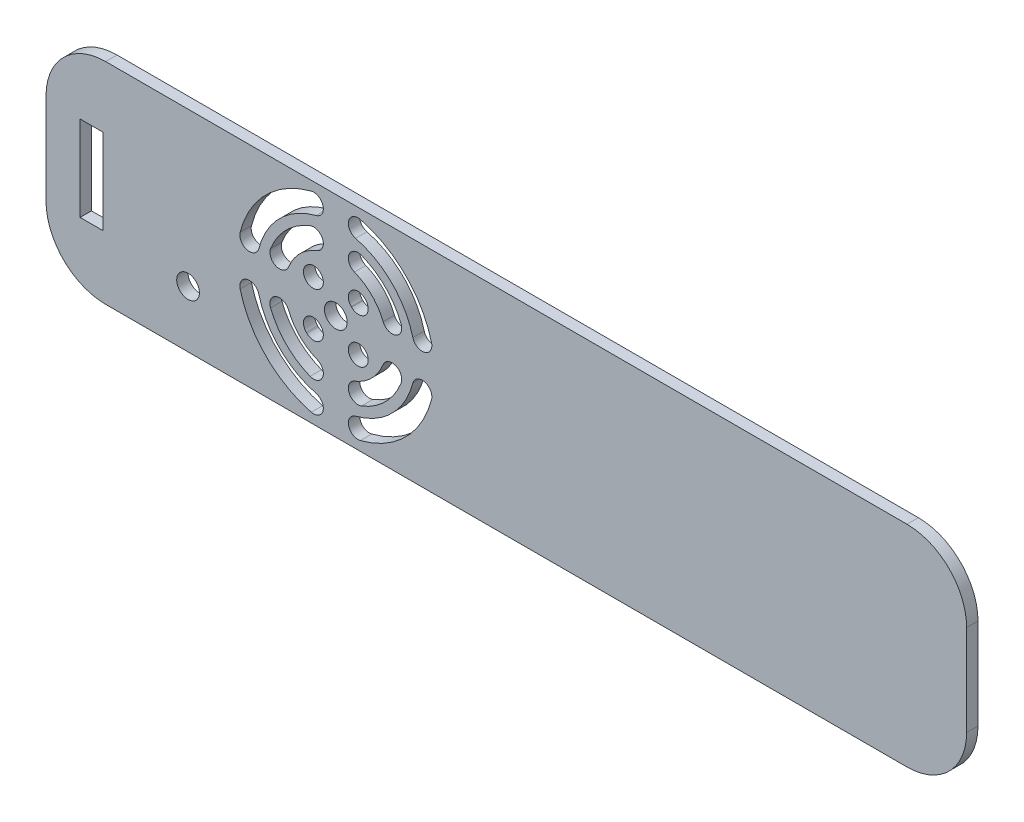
from build123d import *

# Parameters (mm, degrees)
EXTRUDE_1_DEPTH     = 2
SKETCH_2_W          = 4
SKETCH_2_H          = 15
CUT_EXTRUDE_1_DEPTH = 84.109867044
SKETCH_3_R          = 2
CUT_EXTRUDE_2_DEPTH = 84.109867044
SKETCH_4_R          = 2
CUT_EXTRUDE_3_DEPTH = 84.109867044


with BuildPart() as part:
    # Sketch 1 → Extrude 1 (new body)
    with BuildSketch(Plane.XY):
        with BuildLine():
            Line((-70.5, 18.5), (70.5, 18.5))
            ThreePointArc((70.5, 18.5), (77.924621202, 15.424621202), (81, 8))
            Line((81, 8), (81, -8))
            ThreePointArc((81, -8), (77.924621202, -15.424621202), (70.5, -18.5))
            Line((70.5, -18.5), (-70.5, -18.5))
            ThreePointArc((-70.5, -18.5), (-77.924621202, -15.424621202), (-81, -8))
            Line((-81, -8), (-81, 8))
            ThreePointArc((-81, 8), (-77.924621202, 15.424621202), (-70.5, 18.5))
        make_face()
    extrude(amount=EXTRUDE_1_DEPTH)

    # Sketch 2 → Cut-Extrude 1 (cut, through all)
    with BuildSketch(Plane.XY.offset(2)):
        with Locations((-73, 0)):
            Rectangle(SKETCH_2_W, SKETCH_2_H)
    extrude(amount=-CUT_EXTRUDE_1_DEPTH, mode=Mode.SUBTRACT)

    # Sketch 3 → Cut-Extrude 2 (cut, through all)
    with BuildSketch(Plane.XY.offset(2)):
        with Locations((-30, 0)):
            Circle(SKETCH_3_R)
        with BuildLine():
            ThreePointArc((-13.155630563, 4.322558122), (-17.703307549, 12.296692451), (-25.677441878, 16.844369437))
            ThreePointArc((-25.677441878, 16.844369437), (-27.746646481, 15.620281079), (-26.522558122, 13.551076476))
            ThreePointArc((-26.522558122, 13.551076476), (-20.107470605, 9.892529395), (-16.448923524, 3.477441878))
            ThreePointArc((-16.448923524, 3.477441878), (-14.379718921, 2.253353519), (-13.155630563, 4.322558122))
        make_face()
        with BuildLine():
            ThreePointArc((-18.520631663, 4.523215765), (-21.275454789, 8.724545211), (-25.476784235, 11.479368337))
            ThreePointArc((-25.476784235, 11.479368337), (-27.681645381, 10.520938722), (-26.723215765, 8.316077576))
            ThreePointArc((-26.723215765, 8.316077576), (-23.679617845, 6.320382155), (-21.683922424, 3.276784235))
            ThreePointArc((-21.683922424, 3.276784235), (-19.479061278, 2.318354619), (-18.520631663, 4.523215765))
        make_face()
        with BuildLine():
            ThreePointArc((-24.782799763, 5.086770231), (-24.847602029, 5.152397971), (-24.913229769, 5.217200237))
            ThreePointArc((-24.913229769, 5.217200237), (-27.317200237, 5.186770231), (-27.286770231, 2.782799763))
            ThreePointArc((-27.286770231, 2.782799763), (-27.251765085, 2.748234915), (-27.217200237, 2.713229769))
            ThreePointArc((-27.217200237, 2.713229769), (-24.813229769, 2.682799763), (-24.782799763, 5.086770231))
        make_face()
        with BuildLine():
            ThreePointArc((-25.677441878, -16.844369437), (-17.703307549, -12.296692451), (-13.155630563, -4.322558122))
            ThreePointArc((-13.155630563, -4.322558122), (-14.379718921, -2.253353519), (-16.448923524, -3.477441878))
            ThreePointArc((-16.448923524, -3.477441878), (-20.107470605, -9.892529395), (-26.522558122, -13.551076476))
            ThreePointArc((-26.522558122, -13.551076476), (-27.746646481, -15.620281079), (-25.677441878, -16.844369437))
        make_face()
        with BuildLine():
            ThreePointArc((-25.476784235, -11.479368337), (-21.275454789, -8.724545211), (-18.520631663, -4.523215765))
            ThreePointArc((-18.520631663, -4.523215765), (-19.479061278, -2.318354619), (-21.683922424, -3.276784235))
            ThreePointArc((-21.683922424, -3.276784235), (-23.679617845, -6.320382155), (-26.723215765, -8.316077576))
            ThreePointArc((-26.723215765, -8.316077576), (-27.681645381, -10.520938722), (-25.476784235, -11.479368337))
        make_face()
        with BuildLine():
            ThreePointArc((-24.913229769, -5.217200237), (-24.847602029, -5.152397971), (-24.782799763, -5.086770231))
            ThreePointArc((-24.782799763, -5.086770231), (-24.813229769, -2.682799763), (-27.217200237, -2.713229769))
            ThreePointArc((-27.217200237, -2.713229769), (-27.251765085, -2.748234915), (-27.286770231, -2.782799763))
            ThreePointArc((-27.286770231, -2.782799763), (-27.317200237, -5.186770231), (-24.913229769, -5.217200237))
        make_face()
        with BuildLine():
            ThreePointArc((-46.844369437, -4.322558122), (-42.296692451, -12.296692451), (-34.322558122, -16.844369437))
            ThreePointArc((-34.322558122, -16.844369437), (-32.253353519, -15.620281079), (-33.477441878, -13.551076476))
            ThreePointArc((-33.477441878, -13.551076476), (-39.892529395, -9.892529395), (-43.551076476, -3.477441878))
            ThreePointArc((-43.551076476, -3.477441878), (-45.620281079, -2.253353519), (-46.844369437, -4.322558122))
        make_face()
        with BuildLine():
            ThreePointArc((-41.479368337, -4.523215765), (-38.724545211, -8.724545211), (-34.523215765, -11.479368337))
            ThreePointArc((-34.523215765, -11.479368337), (-32.318354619, -10.520938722), (-33.276784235, -8.316077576))
            ThreePointArc((-33.276784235, -8.316077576), (-36.320382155, -6.320382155), (-38.316077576, -3.276784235))
            ThreePointArc((-38.316077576, -3.276784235), (-40.520938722, -2.318354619), (-41.479368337, -4.523215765))
        make_face()
        with BuildLine():
            ThreePointArc((-35.217200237, -5.086770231), (-35.152397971, -5.152397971), (-35.086770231, -5.217200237))
            ThreePointArc((-35.086770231, -5.217200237), (-32.682799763, -5.186770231), (-32.713229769, -2.782799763))
            ThreePointArc((-32.713229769, -2.782799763), (-32.748234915, -2.748234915), (-32.782799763, -2.713229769))
            ThreePointArc((-32.782799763, -2.713229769), (-35.186770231, -2.682799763), (-35.217200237, -5.086770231))
        make_face()
        with BuildLine():
            ThreePointArc((-34.322558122, 16.844369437), (-42.296692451, 12.296692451), (-46.844369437, 4.322558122))
            ThreePointArc((-46.844369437, 4.322558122), (-45.620281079, 2.253353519), (-43.551076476, 3.477441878))
            ThreePointArc((-43.551076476, 3.477441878), (-39.892529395, 9.892529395), (-33.477441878, 13.551076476))
            ThreePointArc((-33.477441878, 13.551076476), (-32.253353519, 15.620281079), (-34.322558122, 16.844369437))
        make_face()
        with BuildLine():
            ThreePointArc((-34.523215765, 11.479368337), (-38.724545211, 8.724545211), (-41.479368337, 4.523215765))
            ThreePointArc((-41.479368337, 4.523215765), (-40.520938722, 2.318354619), (-38.316077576, 3.276784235))
            ThreePointArc((-38.316077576, 3.276784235), (-36.320382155, 6.320382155), (-33.276784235, 8.316077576))
            ThreePointArc((-33.276784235, 8.316077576), (-32.318354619, 10.520938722), (-34.523215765, 11.479368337))
        make_face()
        with BuildLine():
            ThreePointArc((-35.086770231, 5.217200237), (-35.152397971, 5.152397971), (-35.217200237, 5.086770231))
            ThreePointArc((-35.217200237, 5.086770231), (-35.186770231, 2.682799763), (-32.782799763, 2.713229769))
            ThreePointArc((-32.782799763, 2.713229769), (-32.748234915, 2.748234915), (-32.713229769, 2.782799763))
            ThreePointArc((-32.713229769, 2.782799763), (-32.682799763, 5.186770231), (-35.086770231, 5.217200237))
        make_face()
    extrude(amount=-CUT_EXTRUDE_2_DEPTH, mode=Mode.SUBTRACT)

    # Sketch 4 → Cut-Extrude 3 (cut, through all)
    with BuildSketch(Plane.XY.offset(2)):
        with Locations((-56, -8.5)):
            Circle(SKETCH_4_R)
    extrude(amount=-CUT_EXTRUDE_3_DEPTH, mode=Mode.SUBTRACT)


solid = part.part
